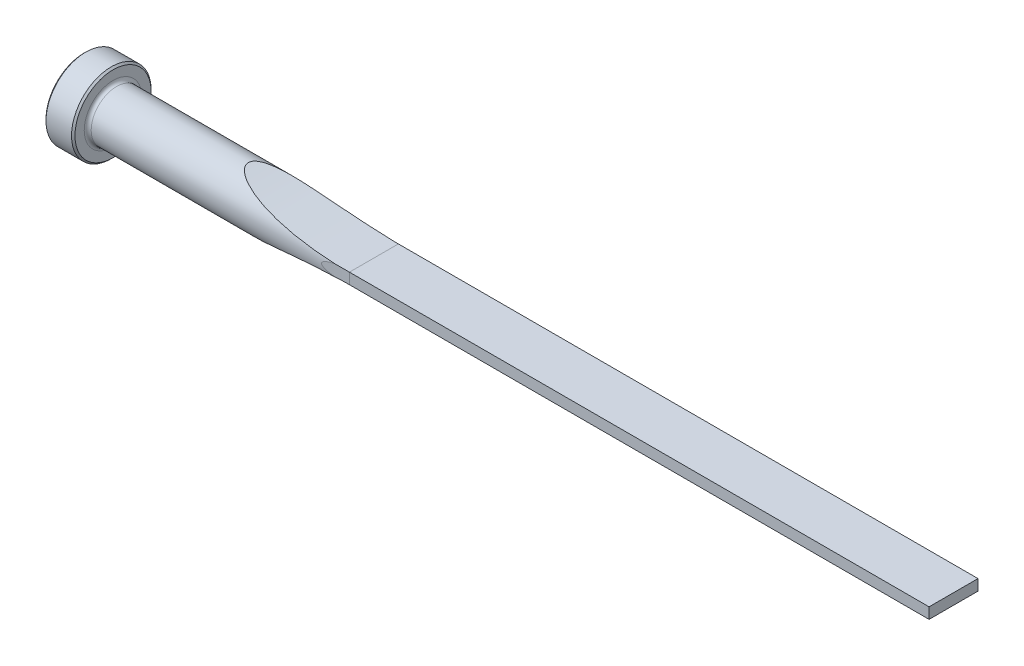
from build123d import *

# Parameters (mm, degrees)
CUT_EXTRUDE1_DEPTH = 191.899182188
CUT_EXTRUDE2_DEPTH = 191.899182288
FILLET1_R          = 0.762
CHAMFER1_SIZE      = 0.381


with BuildPart() as part:
    # Sketch1 → Revolve1 (revolve)
    with BuildSketch(Plane.XY, mode=Mode.PRIVATE) as revolve1_sk:
        Polygon((0, 0), (0, 8.7249), (6.35, 8.7249), (6.35, 5.55625), (190.5, 5.55625), (190.5, 0), align=None)
    revolve(revolve1_sk.sketch.rotate(Axis((0, 0, 0), (1, 0, 0)), 90), axis=Axis((0, 0, 0), (1, 0, 0)))

    # Sketch2 → Cut-Extrude1 (cut, symmetric)
    with BuildSketch(Plane.XY):
        with BuildLine():
            Line((190.5, 5.55625), (190.5, 1.1938))
            Line((190.5, 1.1938), (63.5, 1.1938))
            ThreePointArc((63.5, 1.1938), (49.574810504, 2.291185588), (35.993407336, 5.55625))
            Line((35.993407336, 5.55625), (190.5, 5.55625))
        make_face()
    cut_extrude1 = extrude(amount=CUT_EXTRUDE1_DEPTH, both=True, mode=Mode.SUBTRACT)

    # Mirror1: Cut-Extrude1 across plane
    add(cut_extrude1.mirror(Plane.ZX), mode=Mode.SUBTRACT)

    # Sketch3 → Cut-Extrude2 (cut, symmetric)
    with BuildSketch(Plane(origin=(0, 0, 0), x_dir=(1, 0, 0), z_dir=(0, 1, 0))):
        with BuildLine():
            Line((190.5, 5.55625), (190.5, 5.3594))
            Line((190.5, 5.3594), (63.5, 5.3594))
            ThreePointArc((63.5, 5.3594), (60.541963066, 5.408626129), (57.587202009, 5.55625))
            Line((57.587202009, 5.55625), (190.5, 5.55625))
        make_face()
    cut_extrude2 = extrude(amount=CUT_EXTRUDE2_DEPTH, both=True, mode=Mode.SUBTRACT)

    # Mirror2: Cut-Extrude2 across plane
    add(cut_extrude2.mirror(Plane.XY), mode=Mode.SUBTRACT)

    # Fillet1
    fillet1_edges = [part.edges().sort_by_distance(p)[0] for p in [
        (6.35, 0, -5.55625),
    ]]
    fillet(fillet1_edges, radius=FILLET1_R)

    # Chamfer1
    chamfer1_edges = [part.edges().sort_by_distance(p)[0] for p in [
        (6.35, 0, -8.7249),
        (0, 0, -8.7249),
    ]]
    chamfer(chamfer1_edges, length=CHAMFER1_SIZE)


solid = part.part
